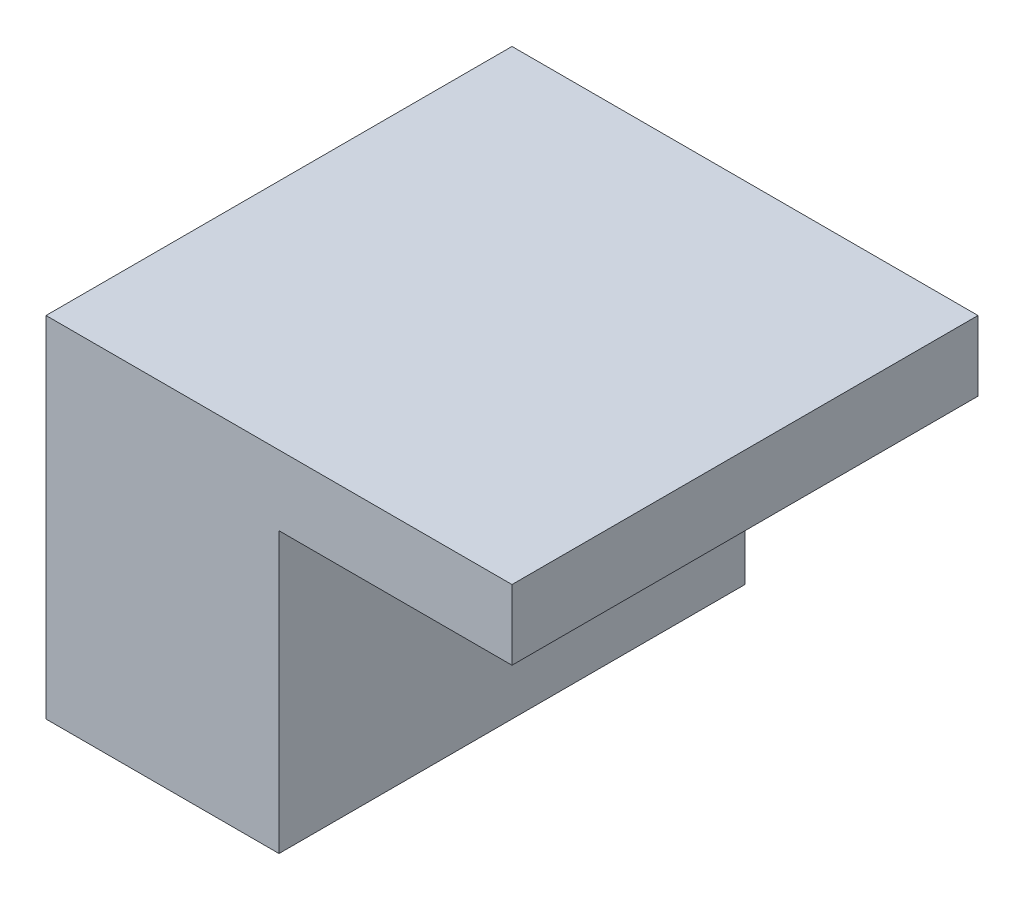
from build123d import *

# Parameters (mm, degrees)
SKETCH_1_W      = 100
SKETCH_1_H      = 200
SKETCH_1_W_2    = 80
SKETCH_1_H_2    = 180
EXTRUDE_1_DEPTH = 150
EXTRUDE_START   = 150
SKETCH_1_3_W    = 100
SKETCH_1_3_H    = 200
EXTRUDE_2_DEPTH = 30
SKETCH_1_4_W    = 80
SKETCH_1_4_H    = 180
EXTRUDE_3_DEPTH = 30
SKETCH_1_5_W    = 80
SKETCH_1_5_H    = 180
EXTRUDE_4_DEPTH = 30


with BuildPart() as part:
    # Sketch 1 → Extrude 1 (new body)
    with BuildSketch(Plane(origin=(0, 0, 0), x_dir=(1, 0, 0), z_dir=(0, 1, 0))):
        with Locations((-50, 0)):
            Rectangle(SKETCH_1_W, SKETCH_1_H)
        with Locations((-50, 0)):
            Rectangle(SKETCH_1_W_2, SKETCH_1_H_2, mode=Mode.SUBTRACT)
    extrude(amount=EXTRUDE_1_DEPTH)

    # Sketch 1_3 → Extrude 2 (add)
    with BuildSketch(Plane(origin=(0, 0, 0), x_dir=(1, 0, 0), z_dir=(0, 1, 0)).offset(EXTRUDE_START)):
        with Locations((50, 0)):
            Rectangle(SKETCH_1_3_W, SKETCH_1_3_H)
    extrude(amount=-EXTRUDE_2_DEPTH)

    # Sketch 1_4 → Extrude 3 (add)
    with BuildSketch(Plane(origin=(0, 0, 0), x_dir=(1, 0, 0), z_dir=(0, 1, 0))):
        with Locations((-50, 0)):
            Rectangle(SKETCH_1_4_W, SKETCH_1_4_H)
    extrude(amount=EXTRUDE_3_DEPTH)

    # Sketch 1_5 → Extrude 4 (add)
    with BuildSketch(Plane(origin=(0, 0, 0), x_dir=(1, 0, 0), z_dir=(0, 1, 0)).offset(EXTRUDE_START)):
        with Locations((-50, 0)):
            Rectangle(SKETCH_1_5_W, SKETCH_1_5_H)
    extrude(amount=-EXTRUDE_4_DEPTH)


solid = part.part
